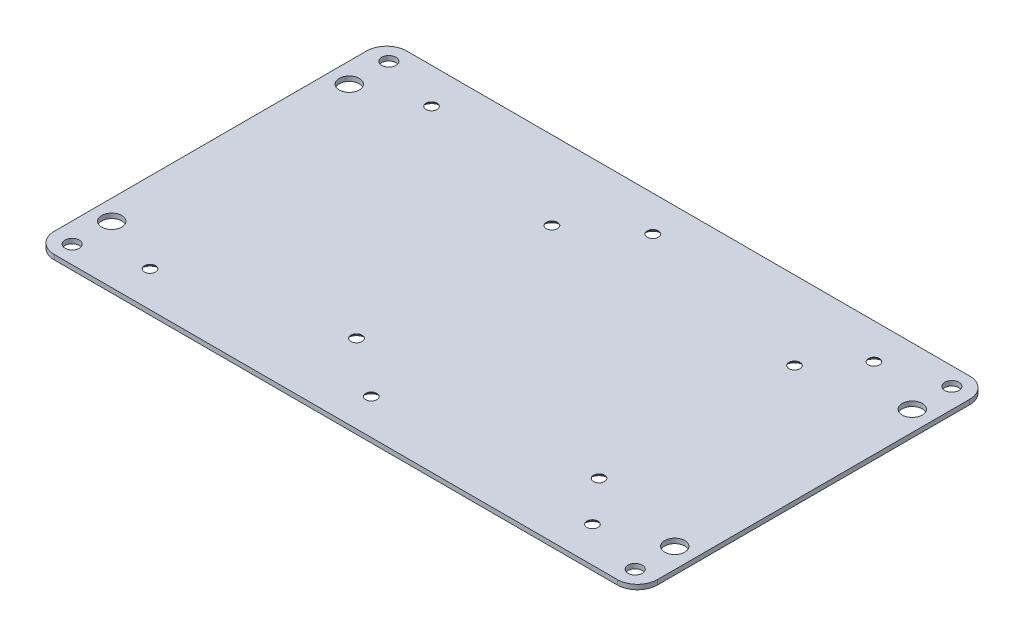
ISO-10303-21;
HEADER;
FILE_DESCRIPTION(('STEP AP214'),'2;1');
FILE_NAME('part.step','',(''),(''),'','','');
FILE_SCHEMA(('AUTOMOTIVE_DESIGN { 1 0 10303 214 1 1 1 1 }'));
ENDSEC;
DATA;
#1=APPLICATION_CONTEXT('core data for automotive mechanical design processes');
#2=APPLICATION_PROTOCOL_DEFINITION('international standard','automotive_design',2000,#1);
#3=PRODUCT_CONTEXT('',#1,'mechanical');
#4=PRODUCT('Part','Part','',(#3));
#5=PRODUCT_RELATED_PRODUCT_CATEGORY('part','',(#4));
#6=PRODUCT_DEFINITION_FORMATION('','',#4);
#7=PRODUCT_DEFINITION_CONTEXT('part definition',#1,'design');
#8=PRODUCT_DEFINITION('design','',#6,#7);
#9=PRODUCT_DEFINITION_SHAPE('','',#8);
#10=(LENGTH_UNIT() NAMED_UNIT(*) SI_UNIT(.MILLI.,.METRE.));
#11=(NAMED_UNIT(*) PLANE_ANGLE_UNIT() SI_UNIT($,.RADIAN.));
#12=(NAMED_UNIT(*) SI_UNIT($,.STERADIAN.) SOLID_ANGLE_UNIT());
#13=UNCERTAINTY_MEASURE_WITH_UNIT(LENGTH_MEASURE(1.E-05),#10,'distance_accuracy_value','');
#14=(GEOMETRIC_REPRESENTATION_CONTEXT(3) GLOBAL_UNCERTAINTY_ASSIGNED_CONTEXT((#13)) GLOBAL_UNIT_ASSIGNED_CONTEXT((#10,
#11,#12)) REPRESENTATION_CONTEXT('',''));
#15=CARTESIAN_POINT('',(0.,0.,0.));
#16=DIRECTION('',(0.,0.,1.));
#17=DIRECTION('',(1.,0.,0.));
#18=AXIS2_PLACEMENT_3D('',#15,#16,#17);
#19=CARTESIAN_POINT('',(0.,-1.5,0.));
#20=DIRECTION('',(0.,1.,0.));
#21=DIRECTION('',(0.,0.,1.));
#22=AXIS2_PLACEMENT_3D('',#19,#20,#21);
#23=PLANE('',#22);
#24=CARTESIAN_POINT('',(-88.9,-1.5,-105.65));
#25=DIRECTION('',(0.,1.,0.));
#26=DIRECTION('',(0.,0.,1.));
#27=AXIS2_PLACEMENT_3D('',#24,#25,#26);
#28=CIRCLE('',#27,2.25);
#29=CARTESIAN_POINT('',(-88.9,-1.5,-103.4));
#30=VERTEX_POINT('',#29);
#31=EDGE_CURVE('E435',#30,#30,#28,.T.);
#32=ORIENTED_EDGE('',*,*,#31,.T.);
#33=EDGE_LOOP('',(#32));
#34=FACE_BOUND('',#33,.T.);
#35=CARTESIAN_POINT('',(-88.9,-1.5,-5.65));
#36=DIRECTION('',(0.,1.,0.));
#37=DIRECTION('',(0.,0.,1.));
#38=AXIS2_PLACEMENT_3D('',#35,#36,#37);
#39=CIRCLE('',#38,2.25);
#40=CARTESIAN_POINT('',(-88.9,-1.5,-3.4));
#41=VERTEX_POINT('',#40);
#42=EDGE_CURVE('E373',#41,#41,#39,.T.);
#43=ORIENTED_EDGE('',*,*,#42,.T.);
#44=EDGE_LOOP('',(#43));
#45=FACE_BOUND('',#44,.T.);
#46=CARTESIAN_POINT('',(88.9,-1.5,-5.65));
#47=DIRECTION('',(0.,1.,0.));
#48=DIRECTION('',(0.,0.,1.));
#49=AXIS2_PLACEMENT_3D('',#46,#47,#48);
#50=CIRCLE('',#49,2.25);
#51=CARTESIAN_POINT('',(88.9,-1.5,-3.4));
#52=VERTEX_POINT('',#51);
#53=EDGE_CURVE('E372',#52,#52,#50,.T.);
#54=ORIENTED_EDGE('',*,*,#53,.T.);
#55=EDGE_LOOP('',(#54));
#56=FACE_BOUND('',#55,.T.);
#57=CARTESIAN_POINT('',(88.9,-1.5,-105.65));
#58=DIRECTION('',(0.,1.,0.));
#59=DIRECTION('',(0.,0.,1.));
#60=AXIS2_PLACEMENT_3D('',#57,#58,#59);
#61=CIRCLE('',#60,2.25);
#62=CARTESIAN_POINT('',(88.9,-1.5,-103.4));
#63=VERTEX_POINT('',#62);
#64=EDGE_CURVE('E205',#63,#63,#61,.T.);
#65=ORIENTED_EDGE('',*,*,#64,.T.);
#66=EDGE_LOOP('',(#65));
#67=FACE_BOUND('',#66,.T.);
#68=CARTESIAN_POINT('',(-88.9,-1.5,-93.15));
#69=DIRECTION('',(0.,1.,0.));
#70=DIRECTION('',(0.,0.,1.));
#71=AXIS2_PLACEMENT_3D('',#68,#69,#70);
#72=CIRCLE('',#71,3.175);
#73=CARTESIAN_POINT('',(-88.9,-1.5,-89.975));
#74=VERTEX_POINT('',#73);
#75=EDGE_CURVE('E312',#74,#74,#72,.T.);
#76=ORIENTED_EDGE('',*,*,#75,.T.);
#77=EDGE_LOOP('',(#76));
#78=FACE_BOUND('',#77,.T.);
#79=CARTESIAN_POINT('',(-88.9,-1.5,-18.15));
#80=DIRECTION('',(0.,1.,0.));
#81=DIRECTION('',(0.,0.,1.));
#82=AXIS2_PLACEMENT_3D('',#79,#80,#81);
#83=CIRCLE('',#82,3.175);
#84=CARTESIAN_POINT('',(-88.9,-1.5,-14.975));
#85=VERTEX_POINT('',#84);
#86=EDGE_CURVE('E347',#85,#85,#83,.T.);
#87=ORIENTED_EDGE('',*,*,#86,.T.);
#88=EDGE_LOOP('',(#87));
#89=FACE_BOUND('',#88,.T.);
#90=CARTESIAN_POINT('',(88.9,-1.5,-93.15));
#91=DIRECTION('',(0.,1.,0.));
#92=DIRECTION('',(0.,0.,1.));
#93=AXIS2_PLACEMENT_3D('',#90,#91,#92);
#94=CIRCLE('',#93,3.175);
#95=CARTESIAN_POINT('',(88.9,-1.5,-89.975));
#96=VERTEX_POINT('',#95);
#97=EDGE_CURVE('E220',#96,#96,#94,.T.);
#98=ORIENTED_EDGE('',*,*,#97,.T.);
#99=EDGE_LOOP('',(#98));
#100=FACE_BOUND('',#99,.T.);
#101=CARTESIAN_POINT('',(88.9,-1.5,-18.15));
#102=DIRECTION('',(0.,1.,0.));
#103=DIRECTION('',(0.,0.,1.));
#104=AXIS2_PLACEMENT_3D('',#101,#102,#103);
#105=CIRCLE('',#104,3.175);
#106=CARTESIAN_POINT('',(88.9,-1.5,-14.975));
#107=VERTEX_POINT('',#106);
#108=EDGE_CURVE('E219',#107,#107,#105,.T.);
#109=ORIENTED_EDGE('',*,*,#108,.T.);
#110=EDGE_LOOP('',(#109));
#111=FACE_BOUND('',#110,.T.);
#112=CARTESIAN_POINT('',(-69.85,-1.5,-11.2));
#113=DIRECTION('',(0.,-1.,0.));
#114=DIRECTION('',(0.,0.,-1.));
#115=AXIS2_PLACEMENT_3D('',#112,#113,#114);
#116=CIRCLE('',#115,3.15);
#117=CARTESIAN_POINT('',(-69.85,-1.5,-14.35));
#118=VERTEX_POINT('',#117);
#119=EDGE_CURVE('E253',#118,#118,#116,.T.);
#120=ORIENTED_EDGE('',*,*,#119,.F.);
#121=EDGE_LOOP('',(#120));
#122=FACE_BOUND('',#121,.T.);
#123=DIRECTION('',(1.,0.,0.));
#124=VECTOR('',#123,1.);
#125=CARTESIAN_POINT('',(-95.25,-1.5,0.));
#126=LINE('',#125,#124);
#127=CARTESIAN_POINT('',(-88.9,-1.5,0.));
#128=VERTEX_POINT('',#127);
#129=CARTESIAN_POINT('',(88.9,-1.5,0.));
#130=VERTEX_POINT('',#129);
#131=EDGE_CURVE('E200',#128,#130,#126,.T.);
#132=ORIENTED_EDGE('',*,*,#131,.F.);
#133=CARTESIAN_POINT('',(-88.9,-1.5,-6.34999999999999));
#134=DIRECTION('',(0.,1.,0.));
#135=DIRECTION('',(0.,0.,1.));
#136=AXIS2_PLACEMENT_3D('',#133,#134,#135);
#137=CIRCLE('',#136,6.35);
#138=CARTESIAN_POINT('',(-95.25,-1.5,-6.34999999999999));
#139=VERTEX_POINT('',#138);
#140=EDGE_CURVE('E183',#128,#139,#137,.F.);
#141=ORIENTED_EDGE('',*,*,#140,.T.);
#142=DIRECTION('',(0.,0.,1.));
#143=VECTOR('',#142,1.);
#144=CARTESIAN_POINT('',(-95.25,-1.5,-111.3));
#145=LINE('',#144,#143);
#146=CARTESIAN_POINT('',(-95.25,-1.5,-104.95));
#147=VERTEX_POINT('',#146);
#148=EDGE_CURVE('E318',#147,#139,#145,.T.);
#149=ORIENTED_EDGE('',*,*,#148,.F.);
#150=CARTESIAN_POINT('',(-88.9,-1.5,-104.95));
#151=DIRECTION('',(0.,1.,0.));
#152=DIRECTION('',(0.,0.,1.));
#153=AXIS2_PLACEMENT_3D('',#150,#151,#152);
#154=CIRCLE('',#153,6.35);
#155=CARTESIAN_POINT('',(-88.9,-1.5,-111.3));
#156=VERTEX_POINT('',#155);
#157=EDGE_CURVE('E146',#147,#156,#154,.F.);
#158=ORIENTED_EDGE('',*,*,#157,.T.);
#159=DIRECTION('',(-1.,0.,0.));
#160=VECTOR('',#159,1.);
#161=CARTESIAN_POINT('',(-95.25,-1.5,-111.3));
#162=LINE('',#161,#160);
#163=CARTESIAN_POINT('',(88.9,-1.5,-111.3));
#164=VERTEX_POINT('',#163);
#165=EDGE_CURVE('E148',#164,#156,#162,.T.);
#166=ORIENTED_EDGE('',*,*,#165,.F.);
#167=CARTESIAN_POINT('',(88.9,-1.5,-104.95));
#168=DIRECTION('',(0.,1.,0.));
#169=DIRECTION('',(0.,0.,1.));
#170=AXIS2_PLACEMENT_3D('',#167,#168,#169);
#171=CIRCLE('',#170,6.35);
#172=CARTESIAN_POINT('',(95.25,-1.5,-104.95));
#173=VERTEX_POINT('',#172);
#174=EDGE_CURVE('E67',#164,#173,#171,.F.);
#175=ORIENTED_EDGE('',*,*,#174,.T.);
#176=DIRECTION('',(0.,0.,-1.));
#177=VECTOR('',#176,1.);
#178=CARTESIAN_POINT('',(95.25,-1.5,-111.3));
#179=LINE('',#178,#177);
#180=CARTESIAN_POINT('',(95.25,-1.5,-6.34999999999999));
#181=VERTEX_POINT('',#180);
#182=EDGE_CURVE('E158',#181,#173,#179,.T.);
#183=ORIENTED_EDGE('',*,*,#182,.F.);
#184=CARTESIAN_POINT('',(88.9,-1.5,-6.35));
#185=DIRECTION('',(0.,1.,0.));
#186=DIRECTION('',(0.,0.,1.));
#187=AXIS2_PLACEMENT_3D('',#184,#185,#186);
#188=CIRCLE('',#187,6.35);
#189=EDGE_CURVE('E176',#181,#130,#188,.F.);
#190=ORIENTED_EDGE('',*,*,#189,.T.);
#191=EDGE_LOOP('',(#132,#141,#149,#158,#166,#175,#183,#190));
#192=FACE_BOUND('',#191,.T.);
#193=CARTESIAN_POINT('',(0.,-1.5,-100.1));
#194=DIRECTION('',(0.,-1.,0.));
#195=DIRECTION('',(0.,0.,-1.));
#196=AXIS2_PLACEMENT_3D('',#193,#194,#195);
#197=CIRCLE('',#196,3.15);
#198=CARTESIAN_POINT('',(0.,-1.5,-103.25));
#199=VERTEX_POINT('',#198);
#200=EDGE_CURVE('E298',#199,#199,#197,.T.);
#201=ORIENTED_EDGE('',*,*,#200,.F.);
#202=EDGE_LOOP('',(#201));
#203=FACE_BOUND('',#202,.T.);
#204=CARTESIAN_POINT('',(0.,-1.5,-11.2));
#205=DIRECTION('',(0.,-1.,0.));
#206=DIRECTION('',(0.,0.,-1.));
#207=AXIS2_PLACEMENT_3D('',#204,#205,#206);
#208=CIRCLE('',#207,3.15);
#209=CARTESIAN_POINT('',(0.,-1.5,-14.35));
#210=VERTEX_POINT('',#209);
#211=EDGE_CURVE('E243',#210,#210,#208,.T.);
#212=ORIENTED_EDGE('',*,*,#211,.F.);
#213=EDGE_LOOP('',(#212));
#214=FACE_BOUND('',#213,.T.);
#215=CARTESIAN_POINT('',(-69.85,-1.5,-100.1));
#216=DIRECTION('',(0.,-1.,0.));
#217=DIRECTION('',(0.,0.,-1.));
#218=AXIS2_PLACEMENT_3D('',#215,#216,#217);
#219=CIRCLE('',#218,3.15);
#220=CARTESIAN_POINT('',(-69.85,-1.5,-103.25));
#221=VERTEX_POINT('',#220);
#222=EDGE_CURVE('E267',#221,#221,#219,.T.);
#223=ORIENTED_EDGE('',*,*,#222,.F.);
#224=EDGE_LOOP('',(#223));
#225=FACE_BOUND('',#224,.T.);
#226=CARTESIAN_POINT('',(69.85,-1.5,-11.2));
#227=DIRECTION('',(0.,-1.,0.));
#228=DIRECTION('',(0.,0.,-1.));
#229=AXIS2_PLACEMENT_3D('',#226,#227,#228);
#230=CIRCLE('',#229,3.15);
#231=CARTESIAN_POINT('',(69.85,-1.5,-14.35));
#232=VERTEX_POINT('',#231);
#233=EDGE_CURVE('E275',#232,#232,#230,.T.);
#234=ORIENTED_EDGE('',*,*,#233,.F.);
#235=EDGE_LOOP('',(#234));
#236=FACE_BOUND('',#235,.T.);
#237=CARTESIAN_POINT('',(69.85,-1.5,-100.1));
#238=DIRECTION('',(0.,-1.,0.));
#239=DIRECTION('',(0.,0.,-1.));
#240=AXIS2_PLACEMENT_3D('',#237,#238,#239);
#241=CIRCLE('',#240,3.15);
#242=CARTESIAN_POINT('',(69.85,-1.5,-103.25));
#243=VERTEX_POINT('',#242);
#244=EDGE_CURVE('E323',#243,#243,#241,.T.);
#245=ORIENTED_EDGE('',*,*,#244,.F.);
#246=EDGE_LOOP('',(#245));
#247=FACE_BOUND('',#246,.T.);
#248=CARTESIAN_POINT('',(58.35,-1.5,-24.79));
#249=DIRECTION('',(0.,-1.,0.));
#250=DIRECTION('',(0.,0.,-1.));
#251=AXIS2_PLACEMENT_3D('',#248,#249,#250);
#252=CIRCLE('',#251,3.15);
#253=CARTESIAN_POINT('',(58.35,-1.5,-27.94));
#254=VERTEX_POINT('',#253);
#255=EDGE_CURVE('E284',#254,#254,#252,.T.);
#256=ORIENTED_EDGE('',*,*,#255,.F.);
#257=EDGE_LOOP('',(#256));
#258=FACE_BOUND('',#257,.T.);
#259=CARTESIAN_POINT('',(58.35,-1.5,-86.51));
#260=DIRECTION('',(0.,-1.,0.));
#261=DIRECTION('',(0.,0.,-1.));
#262=AXIS2_PLACEMENT_3D('',#259,#260,#261);
#263=CIRCLE('',#262,3.15);
#264=CARTESIAN_POINT('',(58.35,-1.5,-89.66));
#265=VERTEX_POINT('',#264);
#266=EDGE_CURVE('E353',#265,#265,#263,.T.);
#267=ORIENTED_EDGE('',*,*,#266,.F.);
#268=EDGE_LOOP('',(#267));
#269=FACE_BOUND('',#268,.T.);
#270=CARTESIAN_POINT('',(-18.25,-1.5,-86.51));
#271=DIRECTION('',(0.,-1.,0.));
#272=DIRECTION('',(0.,0.,-1.));
#273=AXIS2_PLACEMENT_3D('',#270,#271,#272);
#274=CIRCLE('',#273,3.15);
#275=CARTESIAN_POINT('',(-18.25,-1.5,-89.66));
#276=VERTEX_POINT('',#275);
#277=EDGE_CURVE('E338',#276,#276,#274,.T.);
#278=ORIENTED_EDGE('',*,*,#277,.F.);
#279=EDGE_LOOP('',(#278));
#280=FACE_BOUND('',#279,.T.);
#281=CARTESIAN_POINT('',(-18.25,-1.5,-24.79));
#282=DIRECTION('',(0.,-1.,0.));
#283=DIRECTION('',(0.,0.,-1.));
#284=AXIS2_PLACEMENT_3D('',#281,#282,#283);
#285=CIRCLE('',#284,3.15);
#286=CARTESIAN_POINT('',(-18.25,-1.5,-27.94));
#287=VERTEX_POINT('',#286);
#288=EDGE_CURVE('E235',#287,#287,#285,.T.);
#289=ORIENTED_EDGE('',*,*,#288,.F.);
#290=EDGE_LOOP('',(#289));
#291=FACE_BOUND('',#290,.T.);
#292=ADVANCED_FACE('F51',(#34,#45,#56,#67,#78,#89,#100,#111,#122,#192,#203,#214,#225,#236,#247,
#258,#269,#280,#291),#23,.F.);
#293=CARTESIAN_POINT('',(-95.25,-1.5,-111.3));
#294=DIRECTION('',(-1.,0.,0.));
#295=DIRECTION('',(0.,0.,1.));
#296=AXIS2_PLACEMENT_3D('',#293,#294,#295);
#297=PLANE('',#296);
#298=ORIENTED_EDGE('',*,*,#148,.T.);
#299=DIRECTION('',(0.,1.,0.));
#300=VECTOR('',#299,1.);
#301=CARTESIAN_POINT('',(-95.25,-1.5,-6.34999999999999));
#302=LINE('',#301,#300);
#303=CARTESIAN_POINT('',(-95.25,0.,-6.34999999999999));
#304=VERTEX_POINT('',#303);
#305=EDGE_CURVE('E139',#139,#304,#302,.T.);
#306=ORIENTED_EDGE('',*,*,#305,.T.);
#307=DIRECTION('',(0.,0.,1.));
#308=VECTOR('',#307,1.);
#309=CARTESIAN_POINT('',(-95.25,0.,-111.3));
#310=LINE('',#309,#308);
#311=CARTESIAN_POINT('',(-95.25,0.,-104.95));
#312=VERTEX_POINT('',#311);
#313=EDGE_CURVE('E121',#312,#304,#310,.T.);
#314=ORIENTED_EDGE('',*,*,#313,.F.);
#315=DIRECTION('',(0.,1.,0.));
#316=VECTOR('',#315,1.);
#317=CARTESIAN_POINT('',(-95.25,-1.5,-104.95));
#318=LINE('',#317,#316);
#319=EDGE_CURVE('E136',#312,#147,#318,.F.);
#320=ORIENTED_EDGE('',*,*,#319,.T.);
#321=EDGE_LOOP('',(#298,#306,#314,#320));
#322=FACE_BOUND('',#321,.T.);
#323=ADVANCED_FACE('F135',(#322),#297,.T.);
#324=CARTESIAN_POINT('',(-95.25,-1.5,-111.3));
#325=DIRECTION('',(0.,0.,-1.));
#326=DIRECTION('',(-1.,0.,0.));
#327=AXIS2_PLACEMENT_3D('',#324,#325,#326);
#328=PLANE('',#327);
#329=ORIENTED_EDGE('',*,*,#165,.T.);
#330=DIRECTION('',(0.,1.,0.));
#331=VECTOR('',#330,1.);
#332=CARTESIAN_POINT('',(-88.9,-1.5,-111.3));
#333=LINE('',#332,#331);
#334=CARTESIAN_POINT('',(-88.9,0.,-111.3));
#335=VERTEX_POINT('',#334);
#336=EDGE_CURVE('E189',#156,#335,#333,.T.);
#337=ORIENTED_EDGE('',*,*,#336,.T.);
#338=DIRECTION('',(-1.,0.,0.));
#339=VECTOR('',#338,1.);
#340=CARTESIAN_POINT('',(-95.25,0.,-111.3));
#341=LINE('',#340,#339);
#342=CARTESIAN_POINT('',(88.9,0.,-111.3));
#343=VERTEX_POINT('',#342);
#344=EDGE_CURVE('E123',#343,#335,#341,.T.);
#345=ORIENTED_EDGE('',*,*,#344,.F.);
#346=DIRECTION('',(0.,1.,0.));
#347=VECTOR('',#346,1.);
#348=CARTESIAN_POINT('',(88.9,-1.5,-111.3));
#349=LINE('',#348,#347);
#350=EDGE_CURVE('E186',#343,#164,#349,.F.);
#351=ORIENTED_EDGE('',*,*,#350,.T.);
#352=EDGE_LOOP('',(#329,#337,#345,#351));
#353=FACE_BOUND('',#352,.T.);
#354=ADVANCED_FACE('F541',(#353),#328,.T.);
#355=CARTESIAN_POINT('',(95.25,-1.5,-111.3));
#356=DIRECTION('',(1.,0.,0.));
#357=DIRECTION('',(0.,0.,-1.));
#358=AXIS2_PLACEMENT_3D('',#355,#356,#357);
#359=PLANE('',#358);
#360=ORIENTED_EDGE('',*,*,#182,.T.);
#361=DIRECTION('',(0.,1.,0.));
#362=VECTOR('',#361,1.);
#363=CARTESIAN_POINT('',(95.25,-1.5,-104.95));
#364=LINE('',#363,#362);
#365=CARTESIAN_POINT('',(95.25,0.,-104.95));
#366=VERTEX_POINT('',#365);
#367=EDGE_CURVE('E11',#173,#366,#364,.T.);
#368=ORIENTED_EDGE('',*,*,#367,.T.);
#369=DIRECTION('',(0.,0.,-1.));
#370=VECTOR('',#369,1.);
#371=CARTESIAN_POINT('',(95.25,0.,-111.3));
#372=LINE('',#371,#370);
#373=CARTESIAN_POINT('',(95.25,0.,-6.34999999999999));
#374=VERTEX_POINT('',#373);
#375=EDGE_CURVE('E319',#374,#366,#372,.T.);
#376=ORIENTED_EDGE('',*,*,#375,.F.);
#377=DIRECTION('',(0.,1.,0.));
#378=VECTOR('',#377,1.);
#379=CARTESIAN_POINT('',(95.25,-1.5,-6.34999999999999));
#380=LINE('',#379,#378);
#381=EDGE_CURVE('E60',#374,#181,#380,.F.);
#382=ORIENTED_EDGE('',*,*,#381,.T.);
#383=EDGE_LOOP('',(#360,#368,#376,#382));
#384=FACE_BOUND('',#383,.T.);
#385=ADVANCED_FACE('F535',(#384),#359,.T.);
#386=CARTESIAN_POINT('',(-95.25,-1.5,0.));
#387=DIRECTION('',(0.,0.,1.));
#388=DIRECTION('',(1.,0.,0.));
#389=AXIS2_PLACEMENT_3D('',#386,#387,#388);
#390=PLANE('',#389);
#391=DIRECTION('',(1.,0.,0.));
#392=VECTOR('',#391,1.);
#393=CARTESIAN_POINT('',(-95.25,0.,0.));
#394=LINE('',#393,#392);
#395=CARTESIAN_POINT('',(-88.9,0.,0.));
#396=VERTEX_POINT('',#395);
#397=CARTESIAN_POINT('',(88.9,0.,0.));
#398=VERTEX_POINT('',#397);
#399=EDGE_CURVE('E141',#396,#398,#394,.T.);
#400=ORIENTED_EDGE('',*,*,#399,.F.);
#401=DIRECTION('',(0.,1.,0.));
#402=VECTOR('',#401,1.);
#403=CARTESIAN_POINT('',(-88.9,-1.5,0.));
#404=LINE('',#403,#402);
#405=EDGE_CURVE('E173',#396,#128,#404,.F.);
#406=ORIENTED_EDGE('',*,*,#405,.T.);
#407=ORIENTED_EDGE('',*,*,#131,.T.);
#408=DIRECTION('',(0.,1.,0.));
#409=VECTOR('',#408,1.);
#410=CARTESIAN_POINT('',(88.9,-1.5,0.));
#411=LINE('',#410,#409);
#412=EDGE_CURVE('E169',#130,#398,#411,.T.);
#413=ORIENTED_EDGE('',*,*,#412,.T.);
#414=EDGE_LOOP('',(#400,#406,#407,#413));
#415=FACE_BOUND('',#414,.T.);
#416=ADVANCED_FACE('F530',(#415),#390,.T.);
#417=CARTESIAN_POINT('',(0.,0.,0.));
#418=DIRECTION('',(0.,1.,0.));
#419=DIRECTION('',(0.,0.,1.));
#420=AXIS2_PLACEMENT_3D('',#417,#418,#419);
#421=PLANE('',#420);
#422=CARTESIAN_POINT('',(-18.25,0.,-24.79));
#423=DIRECTION('',(0.,1.,0.));
#424=DIRECTION('',(0.,0.,1.));
#425=AXIS2_PLACEMENT_3D('',#422,#423,#424);
#426=CIRCLE('',#425,1.75);
#427=CARTESIAN_POINT('',(-18.25,0.,-23.04));
#428=VERTEX_POINT('',#427);
#429=EDGE_CURVE('E301',#428,#428,#426,.T.);
#430=ORIENTED_EDGE('',*,*,#429,.F.);
#431=EDGE_LOOP('',(#430));
#432=FACE_BOUND('',#431,.T.);
#433=CARTESIAN_POINT('',(-18.25,0.,-86.51));
#434=DIRECTION('',(0.,1.,0.));
#435=DIRECTION('',(0.,0.,1.));
#436=AXIS2_PLACEMENT_3D('',#433,#434,#435);
#437=CIRCLE('',#436,1.75);
#438=CARTESIAN_POINT('',(-18.25,0.,-84.76));
#439=VERTEX_POINT('',#438);
#440=EDGE_CURVE('E337',#439,#439,#437,.T.);
#441=ORIENTED_EDGE('',*,*,#440,.F.);
#442=EDGE_LOOP('',(#441));
#443=FACE_BOUND('',#442,.T.);
#444=CARTESIAN_POINT('',(58.35,0.,-86.51));
#445=DIRECTION('',(0.,1.,0.));
#446=DIRECTION('',(0.,0.,1.));
#447=AXIS2_PLACEMENT_3D('',#444,#445,#446);
#448=CIRCLE('',#447,1.75);
#449=CARTESIAN_POINT('',(58.35,0.,-84.76));
#450=VERTEX_POINT('',#449);
#451=EDGE_CURVE('E281',#450,#450,#448,.T.);
#452=ORIENTED_EDGE('',*,*,#451,.F.);
#453=EDGE_LOOP('',(#452));
#454=FACE_BOUND('',#453,.T.);
#455=CARTESIAN_POINT('',(58.35,0.,-24.79));
#456=DIRECTION('',(0.,1.,0.));
#457=DIRECTION('',(0.,0.,1.));
#458=AXIS2_PLACEMENT_3D('',#455,#456,#457);
#459=CIRCLE('',#458,1.75);
#460=CARTESIAN_POINT('',(58.35,0.,-23.04));
#461=VERTEX_POINT('',#460);
#462=EDGE_CURVE('E225',#461,#461,#459,.T.);
#463=ORIENTED_EDGE('',*,*,#462,.F.);
#464=EDGE_LOOP('',(#463));
#465=FACE_BOUND('',#464,.T.);
#466=CARTESIAN_POINT('',(-88.9,0.,-105.65));
#467=DIRECTION('',(0.,1.,0.));
#468=DIRECTION('',(0.,0.,1.));
#469=AXIS2_PLACEMENT_3D('',#466,#467,#468);
#470=CIRCLE('',#469,2.25);
#471=CARTESIAN_POINT('',(-88.9,0.,-103.4));
#472=VERTEX_POINT('',#471);
#473=EDGE_CURVE('E229',#472,#472,#470,.T.);
#474=ORIENTED_EDGE('',*,*,#473,.F.);
#475=EDGE_LOOP('',(#474));
#476=FACE_BOUND('',#475,.T.);
#477=CARTESIAN_POINT('',(-88.9,0.,-5.65));
#478=DIRECTION('',(0.,1.,0.));
#479=DIRECTION('',(0.,0.,1.));
#480=AXIS2_PLACEMENT_3D('',#477,#478,#479);
#481=CIRCLE('',#480,2.25);
#482=CARTESIAN_POINT('',(-88.9,0.,-3.4));
#483=VERTEX_POINT('',#482);
#484=EDGE_CURVE('E438',#483,#483,#481,.T.);
#485=ORIENTED_EDGE('',*,*,#484,.F.);
#486=EDGE_LOOP('',(#485));
#487=FACE_BOUND('',#486,.T.);
#488=CARTESIAN_POINT('',(88.9,0.,-5.65));
#489=DIRECTION('',(0.,1.,0.));
#490=DIRECTION('',(0.,0.,1.));
#491=AXIS2_PLACEMENT_3D('',#488,#489,#490);
#492=CIRCLE('',#491,2.25);
#493=CARTESIAN_POINT('',(88.9,0.,-3.4));
#494=VERTEX_POINT('',#493);
#495=EDGE_CURVE('E368',#494,#494,#492,.T.);
#496=ORIENTED_EDGE('',*,*,#495,.F.);
#497=EDGE_LOOP('',(#496));
#498=FACE_BOUND('',#497,.T.);
#499=CARTESIAN_POINT('',(88.9,0.,-105.65));
#500=DIRECTION('',(0.,1.,0.));
#501=DIRECTION('',(0.,0.,1.));
#502=AXIS2_PLACEMENT_3D('',#499,#500,#501);
#503=CIRCLE('',#502,2.25);
#504=CARTESIAN_POINT('',(88.9,0.,-103.4));
#505=VERTEX_POINT('',#504);
#506=EDGE_CURVE('E210',#505,#505,#503,.T.);
#507=ORIENTED_EDGE('',*,*,#506,.F.);
#508=EDGE_LOOP('',(#507));
#509=FACE_BOUND('',#508,.T.);
#510=CARTESIAN_POINT('',(-88.9,0.,-93.15));
#511=DIRECTION('',(0.,1.,0.));
#512=DIRECTION('',(0.,0.,1.));
#513=AXIS2_PLACEMENT_3D('',#510,#511,#512);
#514=CIRCLE('',#513,3.175);
#515=CARTESIAN_POINT('',(-88.9,0.,-89.975));
#516=VERTEX_POINT('',#515);
#517=EDGE_CURVE('E209',#516,#516,#514,.T.);
#518=ORIENTED_EDGE('',*,*,#517,.F.);
#519=EDGE_LOOP('',(#518));
#520=FACE_BOUND('',#519,.T.);
#521=CARTESIAN_POINT('',(-88.9,0.,-18.15));
#522=DIRECTION('',(0.,1.,0.));
#523=DIRECTION('',(0.,0.,1.));
#524=AXIS2_PLACEMENT_3D('',#521,#522,#523);
#525=CIRCLE('',#524,3.175);
#526=CARTESIAN_POINT('',(-88.9,0.,-14.975));
#527=VERTEX_POINT('',#526);
#528=EDGE_CURVE('E343',#527,#527,#525,.T.);
#529=ORIENTED_EDGE('',*,*,#528,.F.);
#530=EDGE_LOOP('',(#529));
#531=FACE_BOUND('',#530,.T.);
#532=CARTESIAN_POINT('',(88.9,0.,-93.15));
#533=DIRECTION('',(0.,1.,0.));
#534=DIRECTION('',(0.,0.,1.));
#535=AXIS2_PLACEMENT_3D('',#532,#533,#534);
#536=CIRCLE('',#535,3.175);
#537=CARTESIAN_POINT('',(88.9,0.,-89.975));
#538=VERTEX_POINT('',#537);
#539=EDGE_CURVE('E394',#538,#538,#536,.T.);
#540=ORIENTED_EDGE('',*,*,#539,.F.);
#541=EDGE_LOOP('',(#540));
#542=FACE_BOUND('',#541,.T.);
#543=CARTESIAN_POINT('',(88.9,0.,-18.15));
#544=DIRECTION('',(0.,1.,0.));
#545=DIRECTION('',(0.,0.,1.));
#546=AXIS2_PLACEMENT_3D('',#543,#544,#545);
#547=CIRCLE('',#546,3.175);
#548=CARTESIAN_POINT('',(88.9,0.,-14.975));
#549=VERTEX_POINT('',#548);
#550=EDGE_CURVE('E215',#549,#549,#547,.T.);
#551=ORIENTED_EDGE('',*,*,#550,.F.);
#552=EDGE_LOOP('',(#551));
#553=FACE_BOUND('',#552,.T.);
#554=CARTESIAN_POINT('',(69.85,0.,-100.1));
#555=DIRECTION('',(0.,1.,0.));
#556=DIRECTION('',(0.,0.,1.));
#557=AXIS2_PLACEMENT_3D('',#554,#555,#556);
#558=CIRCLE('',#557,1.75);
#559=CARTESIAN_POINT('',(69.85,0.,-98.35));
#560=VERTEX_POINT('',#559);
#561=EDGE_CURVE('E271',#560,#560,#558,.T.);
#562=ORIENTED_EDGE('',*,*,#561,.F.);
#563=EDGE_LOOP('',(#562));
#564=FACE_BOUND('',#563,.T.);
#565=CARTESIAN_POINT('',(69.85,0.,-11.2));
#566=DIRECTION('',(0.,1.,0.));
#567=DIRECTION('',(0.,0.,1.));
#568=AXIS2_PLACEMENT_3D('',#565,#566,#567);
#569=CIRCLE('',#568,1.75);
#570=CARTESIAN_POINT('',(69.85,0.,-9.45000000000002));
#571=VERTEX_POINT('',#570);
#572=EDGE_CURVE('E258',#571,#571,#569,.T.);
#573=ORIENTED_EDGE('',*,*,#572,.F.);
#574=EDGE_LOOP('',(#573));
#575=FACE_BOUND('',#574,.T.);
#576=CARTESIAN_POINT('',(-69.85,0.,-11.2));
#577=DIRECTION('',(0.,1.,0.));
#578=DIRECTION('',(0.,0.,1.));
#579=AXIS2_PLACEMENT_3D('',#576,#577,#578);
#580=CIRCLE('',#579,1.75);
#581=CARTESIAN_POINT('',(-69.85,0.,-9.45));
#582=VERTEX_POINT('',#581);
#583=EDGE_CURVE('E383',#582,#582,#580,.T.);
#584=ORIENTED_EDGE('',*,*,#583,.F.);
#585=EDGE_LOOP('',(#584));
#586=FACE_BOUND('',#585,.T.);
#587=CARTESIAN_POINT('',(-69.85,0.,-100.1));
#588=DIRECTION('',(0.,1.,0.));
#589=DIRECTION('',(0.,0.,1.));
#590=AXIS2_PLACEMENT_3D('',#587,#588,#589);
#591=CIRCLE('',#590,1.75);
#592=CARTESIAN_POINT('',(-69.85,0.,-98.35));
#593=VERTEX_POINT('',#592);
#594=EDGE_CURVE('E248',#593,#593,#591,.T.);
#595=ORIENTED_EDGE('',*,*,#594,.F.);
#596=EDGE_LOOP('',(#595));
#597=FACE_BOUND('',#596,.T.);
#598=CARTESIAN_POINT('',(0.,0.,-11.2));
#599=DIRECTION('',(0.,1.,0.));
#600=DIRECTION('',(0.,0.,1.));
#601=AXIS2_PLACEMENT_3D('',#598,#599,#600);
#602=CIRCLE('',#601,1.75);
#603=CARTESIAN_POINT('',(0.,0.,-9.45000000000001));
#604=VERTEX_POINT('',#603);
#605=EDGE_CURVE('E444',#604,#604,#602,.T.);
#606=ORIENTED_EDGE('',*,*,#605,.F.);
#607=EDGE_LOOP('',(#606));
#608=FACE_BOUND('',#607,.T.);
#609=CARTESIAN_POINT('',(0.,0.,-100.1));
#610=DIRECTION('',(0.,1.,0.));
#611=DIRECTION('',(0.,0.,1.));
#612=AXIS2_PLACEMENT_3D('',#609,#610,#611);
#613=CIRCLE('',#612,1.75);
#614=CARTESIAN_POINT('',(0.,0.,-98.35));
#615=VERTEX_POINT('',#614);
#616=EDGE_CURVE('E142',#615,#615,#613,.T.);
#617=ORIENTED_EDGE('',*,*,#616,.F.);
#618=EDGE_LOOP('',(#617));
#619=FACE_BOUND('',#618,.T.);
#620=ORIENTED_EDGE('',*,*,#313,.T.);
#621=CARTESIAN_POINT('',(-88.9,0.,-6.34999999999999));
#622=DIRECTION('',(0.,1.,0.));
#623=DIRECTION('',(0.,0.,1.));
#624=AXIS2_PLACEMENT_3D('',#621,#622,#623);
#625=CIRCLE('',#624,6.35);
#626=EDGE_CURVE('E129',#304,#396,#625,.T.);
#627=ORIENTED_EDGE('',*,*,#626,.T.);
#628=ORIENTED_EDGE('',*,*,#399,.T.);
#629=CARTESIAN_POINT('',(88.9,0.,-6.35));
#630=DIRECTION('',(0.,1.,0.));
#631=DIRECTION('',(0.,0.,1.));
#632=AXIS2_PLACEMENT_3D('',#629,#630,#631);
#633=CIRCLE('',#632,6.35);
#634=EDGE_CURVE('E154',#398,#374,#633,.T.);
#635=ORIENTED_EDGE('',*,*,#634,.T.);
#636=ORIENTED_EDGE('',*,*,#375,.T.);
#637=CARTESIAN_POINT('',(88.9,0.,-104.95));
#638=DIRECTION('',(0.,1.,0.));
#639=DIRECTION('',(0.,0.,1.));
#640=AXIS2_PLACEMENT_3D('',#637,#638,#639);
#641=CIRCLE('',#640,6.35);
#642=EDGE_CURVE('E130',#366,#343,#641,.T.);
#643=ORIENTED_EDGE('',*,*,#642,.T.);
#644=ORIENTED_EDGE('',*,*,#344,.T.);
#645=CARTESIAN_POINT('',(-88.9,0.,-104.95));
#646=DIRECTION('',(0.,1.,0.));
#647=DIRECTION('',(0.,0.,1.));
#648=AXIS2_PLACEMENT_3D('',#645,#646,#647);
#649=CIRCLE('',#648,6.35);
#650=EDGE_CURVE('E118',#335,#312,#649,.T.);
#651=ORIENTED_EDGE('',*,*,#650,.T.);
#652=EDGE_LOOP('',(#620,#627,#628,#635,#636,#643,#644,#651));
#653=FACE_BOUND('',#652,.T.);
#654=ADVANCED_FACE('F120',(#432,#443,#454,#465,#476,#487,#498,#509,#520,#531,#542,#553,#564,
#575,#586,#597,#608,#619,#653),#421,.T.);
#655=CARTESIAN_POINT('',(0.,-1.5,-100.1));
#656=DIRECTION('',(0.,-1.,0.));
#657=DIRECTION('',(0.,0.,-1.));
#658=AXIS2_PLACEMENT_3D('',#655,#656,#657);
#659=CYLINDRICAL_SURFACE('',#658,1.75);
#660=CARTESIAN_POINT('',(0.,-0.100000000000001,-100.1));
#661=DIRECTION('',(0.,-1.,0.));
#662=DIRECTION('',(0.,0.,-1.));
#663=AXIS2_PLACEMENT_3D('',#660,#661,#662);
#664=CIRCLE('',#663,1.75);
#665=CARTESIAN_POINT('',(0.,-0.100000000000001,-101.85));
#666=VERTEX_POINT('',#665);
#667=EDGE_CURVE('E361',#666,#666,#664,.T.);
#668=ORIENTED_EDGE('',*,*,#667,.T.);
#669=EDGE_LOOP('',(#668));
#670=FACE_BOUND('',#669,.T.);
#671=ORIENTED_EDGE('',*,*,#616,.T.);
#672=EDGE_LOOP('',(#671));
#673=FACE_BOUND('',#672,.T.);
#674=ADVANCED_FACE('F673',(#670,#673),#659,.F.);
#675=CARTESIAN_POINT('',(0.,-1.5,-100.1));
#676=DIRECTION('',(0.,-1.,0.));
#677=DIRECTION('',(0.,0.,-1.));
#678=AXIS2_PLACEMENT_3D('',#675,#676,#677);
#679=CONICAL_SURFACE('',#678,3.15,0.785398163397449);
#680=ORIENTED_EDGE('',*,*,#667,.F.);
#681=EDGE_LOOP('',(#680));
#682=FACE_BOUND('',#681,.T.);
#683=ORIENTED_EDGE('',*,*,#200,.T.);
#684=EDGE_LOOP('',(#683));
#685=FACE_BOUND('',#684,.T.);
#686=ADVANCED_FACE('F669',(#682,#685),#679,.F.);
#687=CARTESIAN_POINT('',(0.,-1.5,-11.2));
#688=DIRECTION('',(0.,-1.,0.));
#689=DIRECTION('',(0.,0.,-1.));
#690=AXIS2_PLACEMENT_3D('',#687,#688,#689);
#691=CYLINDRICAL_SURFACE('',#690,1.75);
#692=CARTESIAN_POINT('',(0.,-0.100000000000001,-11.2));
#693=DIRECTION('',(0.,-1.,0.));
#694=DIRECTION('',(0.,0.,-1.));
#695=AXIS2_PLACEMENT_3D('',#692,#693,#694);
#696=CIRCLE('',#695,1.75);
#697=CARTESIAN_POINT('',(0.,-0.100000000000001,-12.95));
#698=VERTEX_POINT('',#697);
#699=EDGE_CURVE('E247',#698,#698,#696,.T.);
#700=ORIENTED_EDGE('',*,*,#699,.T.);
#701=EDGE_LOOP('',(#700));
#702=FACE_BOUND('',#701,.T.);
#703=ORIENTED_EDGE('',*,*,#605,.T.);
#704=EDGE_LOOP('',(#703));
#705=FACE_BOUND('',#704,.T.);
#706=ADVANCED_FACE('F665',(#702,#705),#691,.F.);
#707=CARTESIAN_POINT('',(0.,-1.5,-11.2));
#708=DIRECTION('',(0.,-1.,0.));
#709=DIRECTION('',(0.,0.,-1.));
#710=AXIS2_PLACEMENT_3D('',#707,#708,#709);
#711=CONICAL_SURFACE('',#710,3.15,0.785398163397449);
#712=ORIENTED_EDGE('',*,*,#699,.F.);
#713=EDGE_LOOP('',(#712));
#714=FACE_BOUND('',#713,.T.);
#715=ORIENTED_EDGE('',*,*,#211,.T.);
#716=EDGE_LOOP('',(#715));
#717=FACE_BOUND('',#716,.T.);
#718=ADVANCED_FACE('F661',(#714,#717),#711,.F.);
#719=CARTESIAN_POINT('',(-69.85,-1.5,-100.1));
#720=DIRECTION('',(0.,-1.,0.));
#721=DIRECTION('',(0.,0.,-1.));
#722=AXIS2_PLACEMENT_3D('',#719,#720,#721);
#723=CYLINDRICAL_SURFACE('',#722,1.75);
#724=CARTESIAN_POINT('',(-69.85,-0.100000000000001,-100.1));
#725=DIRECTION('',(0.,-1.,0.));
#726=DIRECTION('',(0.,0.,-1.));
#727=AXIS2_PLACEMENT_3D('',#724,#725,#726);
#728=CIRCLE('',#727,1.75);
#729=CARTESIAN_POINT('',(-69.85,-0.100000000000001,-101.85));
#730=VERTEX_POINT('',#729);
#731=EDGE_CURVE('E263',#730,#730,#728,.T.);
#732=ORIENTED_EDGE('',*,*,#731,.T.);
#733=EDGE_LOOP('',(#732));
#734=FACE_BOUND('',#733,.T.);
#735=ORIENTED_EDGE('',*,*,#594,.T.);
#736=EDGE_LOOP('',(#735));
#737=FACE_BOUND('',#736,.T.);
#738=ADVANCED_FACE('F657',(#734,#737),#723,.F.);
#739=CARTESIAN_POINT('',(-69.85,-1.5,-100.1));
#740=DIRECTION('',(0.,-1.,0.));
#741=DIRECTION('',(0.,0.,-1.));
#742=AXIS2_PLACEMENT_3D('',#739,#740,#741);
#743=CONICAL_SURFACE('',#742,3.15,0.785398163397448);
#744=ORIENTED_EDGE('',*,*,#731,.F.);
#745=EDGE_LOOP('',(#744));
#746=FACE_BOUND('',#745,.T.);
#747=ORIENTED_EDGE('',*,*,#222,.T.);
#748=EDGE_LOOP('',(#747));
#749=FACE_BOUND('',#748,.T.);
#750=ADVANCED_FACE('F653',(#746,#749),#743,.F.);
#751=CARTESIAN_POINT('',(-69.85,-1.5,-11.2));
#752=DIRECTION('',(0.,-1.,0.));
#753=DIRECTION('',(0.,0.,-1.));
#754=AXIS2_PLACEMENT_3D('',#751,#752,#753);
#755=CYLINDRICAL_SURFACE('',#754,1.75);
#756=CARTESIAN_POINT('',(-69.85,-0.100000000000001,-11.2));
#757=DIRECTION('',(0.,-1.,0.));
#758=DIRECTION('',(0.,0.,-1.));
#759=AXIS2_PLACEMENT_3D('',#756,#757,#758);
#760=CIRCLE('',#759,1.75);
#761=CARTESIAN_POINT('',(-69.85,-0.100000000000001,-12.95));
#762=VERTEX_POINT('',#761);
#763=EDGE_CURVE('E257',#762,#762,#760,.T.);
#764=ORIENTED_EDGE('',*,*,#763,.T.);
#765=EDGE_LOOP('',(#764));
#766=FACE_BOUND('',#765,.T.);
#767=ORIENTED_EDGE('',*,*,#583,.T.);
#768=EDGE_LOOP('',(#767));
#769=FACE_BOUND('',#768,.T.);
#770=ADVANCED_FACE('F649',(#766,#769),#755,.F.);
#771=CARTESIAN_POINT('',(-69.85,-1.5,-11.2));
#772=DIRECTION('',(0.,-1.,0.));
#773=DIRECTION('',(0.,0.,-1.));
#774=AXIS2_PLACEMENT_3D('',#771,#772,#773);
#775=CONICAL_SURFACE('',#774,3.15,0.785398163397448);
#776=ORIENTED_EDGE('',*,*,#763,.F.);
#777=EDGE_LOOP('',(#776));
#778=FACE_BOUND('',#777,.T.);
#779=ORIENTED_EDGE('',*,*,#119,.T.);
#780=EDGE_LOOP('',(#779));
#781=FACE_BOUND('',#780,.T.);
#782=ADVANCED_FACE('F645',(#778,#781),#775,.F.);
#783=CARTESIAN_POINT('',(69.85,-1.5,-11.2));
#784=DIRECTION('',(0.,-1.,0.));
#785=DIRECTION('',(0.,0.,-1.));
#786=AXIS2_PLACEMENT_3D('',#783,#784,#785);
#787=CYLINDRICAL_SURFACE('',#786,1.75);
#788=CARTESIAN_POINT('',(69.85,-0.100000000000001,-11.2));
#789=DIRECTION('',(0.,-1.,0.));
#790=DIRECTION('',(0.,0.,-1.));
#791=AXIS2_PLACEMENT_3D('',#788,#789,#790);
#792=CIRCLE('',#791,1.75);
#793=CARTESIAN_POINT('',(69.85,-0.100000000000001,-12.95));
#794=VERTEX_POINT('',#793);
#795=EDGE_CURVE('E413',#794,#794,#792,.T.);
#796=ORIENTED_EDGE('',*,*,#795,.T.);
#797=EDGE_LOOP('',(#796));
#798=FACE_BOUND('',#797,.T.);
#799=ORIENTED_EDGE('',*,*,#572,.T.);
#800=EDGE_LOOP('',(#799));
#801=FACE_BOUND('',#800,.T.);
#802=ADVANCED_FACE('F641',(#798,#801),#787,.F.);
#803=CARTESIAN_POINT('',(69.85,-1.5,-11.2));
#804=DIRECTION('',(0.,-1.,0.));
#805=DIRECTION('',(0.,0.,-1.));
#806=AXIS2_PLACEMENT_3D('',#803,#804,#805);
#807=CONICAL_SURFACE('',#806,3.15,0.785398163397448);
#808=ORIENTED_EDGE('',*,*,#795,.F.);
#809=EDGE_LOOP('',(#808));
#810=FACE_BOUND('',#809,.T.);
#811=ORIENTED_EDGE('',*,*,#233,.T.);
#812=EDGE_LOOP('',(#811));
#813=FACE_BOUND('',#812,.T.);
#814=ADVANCED_FACE('F637',(#810,#813),#807,.F.);
#815=CARTESIAN_POINT('',(69.85,-1.5,-100.1));
#816=DIRECTION('',(0.,-1.,0.));
#817=DIRECTION('',(0.,0.,-1.));
#818=AXIS2_PLACEMENT_3D('',#815,#816,#817);
#819=CYLINDRICAL_SURFACE('',#818,1.75);
#820=CARTESIAN_POINT('',(69.85,-0.100000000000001,-100.1));
#821=DIRECTION('',(0.,-1.,0.));
#822=DIRECTION('',(0.,0.,-1.));
#823=AXIS2_PLACEMENT_3D('',#820,#821,#822);
#824=CIRCLE('',#823,1.75);
#825=CARTESIAN_POINT('',(69.85,-0.100000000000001,-101.85));
#826=VERTEX_POINT('',#825);
#827=EDGE_CURVE('E276',#826,#826,#824,.T.);
#828=ORIENTED_EDGE('',*,*,#827,.T.);
#829=EDGE_LOOP('',(#828));
#830=FACE_BOUND('',#829,.T.);
#831=ORIENTED_EDGE('',*,*,#561,.T.);
#832=EDGE_LOOP('',(#831));
#833=FACE_BOUND('',#832,.T.);
#834=ADVANCED_FACE('F633',(#830,#833),#819,.F.);
#835=CARTESIAN_POINT('',(69.85,-1.5,-100.1));
#836=DIRECTION('',(0.,-1.,0.));
#837=DIRECTION('',(0.,0.,-1.));
#838=AXIS2_PLACEMENT_3D('',#835,#836,#837);
#839=CONICAL_SURFACE('',#838,3.15,0.785398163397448);
#840=ORIENTED_EDGE('',*,*,#827,.F.);
#841=EDGE_LOOP('',(#840));
#842=FACE_BOUND('',#841,.T.);
#843=ORIENTED_EDGE('',*,*,#244,.T.);
#844=EDGE_LOOP('',(#843));
#845=FACE_BOUND('',#844,.T.);
#846=ADVANCED_FACE('F629',(#842,#845),#839,.F.);
#847=CARTESIAN_POINT('',(88.9,0.,-18.15));
#848=DIRECTION('',(0.,1.,0.));
#849=DIRECTION('',(0.,0.,1.));
#850=AXIS2_PLACEMENT_3D('',#847,#848,#849);
#851=CYLINDRICAL_SURFACE('',#850,3.175);
#852=ORIENTED_EDGE('',*,*,#108,.F.);
#853=EDGE_LOOP('',(#852));
#854=FACE_BOUND('',#853,.T.);
#855=ORIENTED_EDGE('',*,*,#550,.T.);
#856=EDGE_LOOP('',(#855));
#857=FACE_BOUND('',#856,.T.);
#858=ADVANCED_FACE('F625',(#854,#857),#851,.F.);
#859=CARTESIAN_POINT('',(88.9,0.,-93.15));
#860=DIRECTION('',(0.,1.,0.));
#861=DIRECTION('',(0.,0.,1.));
#862=AXIS2_PLACEMENT_3D('',#859,#860,#861);
#863=CYLINDRICAL_SURFACE('',#862,3.175);
#864=ORIENTED_EDGE('',*,*,#97,.F.);
#865=EDGE_LOOP('',(#864));
#866=FACE_BOUND('',#865,.T.);
#867=ORIENTED_EDGE('',*,*,#539,.T.);
#868=EDGE_LOOP('',(#867));
#869=FACE_BOUND('',#868,.T.);
#870=ADVANCED_FACE('F621',(#866,#869),#863,.F.);
#871=CARTESIAN_POINT('',(-88.9,0.,-18.15));
#872=DIRECTION('',(0.,1.,0.));
#873=DIRECTION('',(0.,0.,1.));
#874=AXIS2_PLACEMENT_3D('',#871,#872,#873);
#875=CYLINDRICAL_SURFACE('',#874,3.175);
#876=ORIENTED_EDGE('',*,*,#86,.F.);
#877=EDGE_LOOP('',(#876));
#878=FACE_BOUND('',#877,.T.);
#879=ORIENTED_EDGE('',*,*,#528,.T.);
#880=EDGE_LOOP('',(#879));
#881=FACE_BOUND('',#880,.T.);
#882=ADVANCED_FACE('F617',(#878,#881),#875,.F.);
#883=CARTESIAN_POINT('',(-88.9,0.,-93.15));
#884=DIRECTION('',(0.,1.,0.));
#885=DIRECTION('',(0.,0.,1.));
#886=AXIS2_PLACEMENT_3D('',#883,#884,#885);
#887=CYLINDRICAL_SURFACE('',#886,3.175);
#888=ORIENTED_EDGE('',*,*,#75,.F.);
#889=EDGE_LOOP('',(#888));
#890=FACE_BOUND('',#889,.T.);
#891=ORIENTED_EDGE('',*,*,#517,.T.);
#892=EDGE_LOOP('',(#891));
#893=FACE_BOUND('',#892,.T.);
#894=ADVANCED_FACE('F613',(#890,#893),#887,.F.);
#895=CARTESIAN_POINT('',(88.9,0.,-105.65));
#896=DIRECTION('',(0.,1.,0.));
#897=DIRECTION('',(0.,0.,1.));
#898=AXIS2_PLACEMENT_3D('',#895,#896,#897);
#899=CYLINDRICAL_SURFACE('',#898,2.25);
#900=ORIENTED_EDGE('',*,*,#64,.F.);
#901=EDGE_LOOP('',(#900));
#902=FACE_BOUND('',#901,.T.);
#903=ORIENTED_EDGE('',*,*,#506,.T.);
#904=EDGE_LOOP('',(#903));
#905=FACE_BOUND('',#904,.T.);
#906=ADVANCED_FACE('F609',(#902,#905),#899,.F.);
#907=CARTESIAN_POINT('',(88.9,0.,-5.65));
#908=DIRECTION('',(0.,1.,0.));
#909=DIRECTION('',(0.,0.,1.));
#910=AXIS2_PLACEMENT_3D('',#907,#908,#909);
#911=CYLINDRICAL_SURFACE('',#910,2.25);
#912=ORIENTED_EDGE('',*,*,#53,.F.);
#913=EDGE_LOOP('',(#912));
#914=FACE_BOUND('',#913,.T.);
#915=ORIENTED_EDGE('',*,*,#495,.T.);
#916=EDGE_LOOP('',(#915));
#917=FACE_BOUND('',#916,.T.);
#918=ADVANCED_FACE('F605',(#914,#917),#911,.F.);
#919=CARTESIAN_POINT('',(-88.9,0.,-5.65));
#920=DIRECTION('',(0.,1.,0.));
#921=DIRECTION('',(0.,0.,1.));
#922=AXIS2_PLACEMENT_3D('',#919,#920,#921);
#923=CYLINDRICAL_SURFACE('',#922,2.25);
#924=ORIENTED_EDGE('',*,*,#42,.F.);
#925=EDGE_LOOP('',(#924));
#926=FACE_BOUND('',#925,.T.);
#927=ORIENTED_EDGE('',*,*,#484,.T.);
#928=EDGE_LOOP('',(#927));
#929=FACE_BOUND('',#928,.T.);
#930=ADVANCED_FACE('F601',(#926,#929),#923,.F.);
#931=CARTESIAN_POINT('',(-88.9,0.,-105.65));
#932=DIRECTION('',(0.,1.,0.));
#933=DIRECTION('',(0.,0.,1.));
#934=AXIS2_PLACEMENT_3D('',#931,#932,#933);
#935=CYLINDRICAL_SURFACE('',#934,2.25);
#936=ORIENTED_EDGE('',*,*,#31,.F.);
#937=EDGE_LOOP('',(#936));
#938=FACE_BOUND('',#937,.T.);
#939=ORIENTED_EDGE('',*,*,#473,.T.);
#940=EDGE_LOOP('',(#939));
#941=FACE_BOUND('',#940,.T.);
#942=ADVANCED_FACE('F598',(#938,#941),#935,.F.);
#943=CARTESIAN_POINT('',(-88.9,-1.5,-6.34999999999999));
#944=DIRECTION('',(0.,1.,0.));
#945=DIRECTION('',(0.,0.,1.));
#946=AXIS2_PLACEMENT_3D('',#943,#944,#945);
#947=CYLINDRICAL_SURFACE('',#946,6.35);
#948=ORIENTED_EDGE('',*,*,#140,.F.);
#949=ORIENTED_EDGE('',*,*,#405,.F.);
#950=ORIENTED_EDGE('',*,*,#626,.F.);
#951=ORIENTED_EDGE('',*,*,#305,.F.);
#952=EDGE_LOOP('',(#948,#949,#950,#951));
#953=FACE_BOUND('',#952,.T.);
#954=ADVANCED_FACE('F526',(#953),#947,.T.);
#955=CARTESIAN_POINT('',(-88.9,-1.5,-104.95));
#956=DIRECTION('',(0.,1.,0.));
#957=DIRECTION('',(0.,0.,1.));
#958=AXIS2_PLACEMENT_3D('',#955,#956,#957);
#959=CYLINDRICAL_SURFACE('',#958,6.35);
#960=ORIENTED_EDGE('',*,*,#157,.F.);
#961=ORIENTED_EDGE('',*,*,#319,.F.);
#962=ORIENTED_EDGE('',*,*,#650,.F.);
#963=ORIENTED_EDGE('',*,*,#336,.F.);
#964=EDGE_LOOP('',(#960,#961,#962,#963));
#965=FACE_BOUND('',#964,.T.);
#966=ADVANCED_FACE('F145',(#965),#959,.T.);
#967=CARTESIAN_POINT('',(88.9,-1.5,-104.95));
#968=DIRECTION('',(0.,1.,0.));
#969=DIRECTION('',(0.,0.,1.));
#970=AXIS2_PLACEMENT_3D('',#967,#968,#969);
#971=CYLINDRICAL_SURFACE('',#970,6.35);
#972=ORIENTED_EDGE('',*,*,#174,.F.);
#973=ORIENTED_EDGE('',*,*,#350,.F.);
#974=ORIENTED_EDGE('',*,*,#642,.F.);
#975=ORIENTED_EDGE('',*,*,#367,.F.);
#976=EDGE_LOOP('',(#972,#973,#974,#975));
#977=FACE_BOUND('',#976,.T.);
#978=ADVANCED_FACE('F538',(#977),#971,.T.);
#979=CARTESIAN_POINT('',(88.9,-1.5,-6.35));
#980=DIRECTION('',(0.,1.,0.));
#981=DIRECTION('',(0.,0.,1.));
#982=AXIS2_PLACEMENT_3D('',#979,#980,#981);
#983=CYLINDRICAL_SURFACE('',#982,6.35);
#984=ORIENTED_EDGE('',*,*,#189,.F.);
#985=ORIENTED_EDGE('',*,*,#381,.F.);
#986=ORIENTED_EDGE('',*,*,#634,.F.);
#987=ORIENTED_EDGE('',*,*,#412,.F.);
#988=EDGE_LOOP('',(#984,#985,#986,#987));
#989=FACE_BOUND('',#988,.T.);
#990=ADVANCED_FACE('F53',(#989),#983,.T.);
#991=CARTESIAN_POINT('',(58.35,-1.5,-24.79));
#992=DIRECTION('',(0.,-1.,0.));
#993=DIRECTION('',(0.,0.,-1.));
#994=AXIS2_PLACEMENT_3D('',#991,#992,#993);
#995=CYLINDRICAL_SURFACE('',#994,1.75);
#996=CARTESIAN_POINT('',(58.35,-0.0999999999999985,-24.79));
#997=DIRECTION('',(0.,-1.,0.));
#998=DIRECTION('',(0.,0.,-1.));
#999=AXIS2_PLACEMENT_3D('',#996,#997,#998);
#1000=CIRCLE('',#999,1.75);
#1001=CARTESIAN_POINT('',(58.35,-0.0999999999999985,-26.54));
#1002=VERTEX_POINT('',#1001);
#1003=EDGE_CURVE('E230',#1002,#1002,#1000,.T.);
#1004=ORIENTED_EDGE('',*,*,#1003,.T.);
#1005=EDGE_LOOP('',(#1004));
#1006=FACE_BOUND('',#1005,.T.);
#1007=ORIENTED_EDGE('',*,*,#462,.T.);
#1008=EDGE_LOOP('',(#1007));
#1009=FACE_BOUND('',#1008,.T.);
#1010=ADVANCED_FACE('F593',(#1006,#1009),#995,.F.);
#1011=CARTESIAN_POINT('',(58.35,-1.5,-24.79));
#1012=DIRECTION('',(0.,-1.,0.));
#1013=DIRECTION('',(0.,0.,-1.));
#1014=AXIS2_PLACEMENT_3D('',#1011,#1012,#1013);
#1015=CONICAL_SURFACE('',#1014,3.15,0.785398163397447);
#1016=ORIENTED_EDGE('',*,*,#1003,.F.);
#1017=EDGE_LOOP('',(#1016));
#1018=FACE_BOUND('',#1017,.T.);
#1019=ORIENTED_EDGE('',*,*,#255,.T.);
#1020=EDGE_LOOP('',(#1019));
#1021=FACE_BOUND('',#1020,.T.);
#1022=ADVANCED_FACE('F589',(#1018,#1021),#1015,.F.);
#1023=CARTESIAN_POINT('',(58.35,-1.5,-86.51));
#1024=DIRECTION('',(0.,-1.,0.));
#1025=DIRECTION('',(0.,0.,-1.));
#1026=AXIS2_PLACEMENT_3D('',#1023,#1024,#1025);
#1027=CYLINDRICAL_SURFACE('',#1026,1.75);
#1028=CARTESIAN_POINT('',(58.35,-0.0999999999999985,-86.51));
#1029=DIRECTION('',(0.,-1.,0.));
#1030=DIRECTION('',(0.,0.,-1.));
#1031=AXIS2_PLACEMENT_3D('',#1028,#1029,#1030);
#1032=CIRCLE('',#1031,1.75);
#1033=CARTESIAN_POINT('',(58.35,-0.0999999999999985,-88.26));
#1034=VERTEX_POINT('',#1033);
#1035=EDGE_CURVE('E285',#1034,#1034,#1032,.T.);
#1036=ORIENTED_EDGE('',*,*,#1035,.T.);
#1037=EDGE_LOOP('',(#1036));
#1038=FACE_BOUND('',#1037,.T.);
#1039=ORIENTED_EDGE('',*,*,#451,.T.);
#1040=EDGE_LOOP('',(#1039));
#1041=FACE_BOUND('',#1040,.T.);
#1042=ADVANCED_FACE('F585',(#1038,#1041),#1027,.F.);
#1043=CARTESIAN_POINT('',(58.35,-1.5,-86.51));
#1044=DIRECTION('',(0.,-1.,0.));
#1045=DIRECTION('',(0.,0.,-1.));
#1046=AXIS2_PLACEMENT_3D('',#1043,#1044,#1045);
#1047=CONICAL_SURFACE('',#1046,3.15,0.785398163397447);
#1048=ORIENTED_EDGE('',*,*,#1035,.F.);
#1049=EDGE_LOOP('',(#1048));
#1050=FACE_BOUND('',#1049,.T.);
#1051=ORIENTED_EDGE('',*,*,#266,.T.);
#1052=EDGE_LOOP('',(#1051));
#1053=FACE_BOUND('',#1052,.T.);
#1054=ADVANCED_FACE('F581',(#1050,#1053),#1047,.F.);
#1055=CARTESIAN_POINT('',(-18.25,-1.5,-86.51));
#1056=DIRECTION('',(0.,-1.,0.));
#1057=DIRECTION('',(0.,0.,-1.));
#1058=AXIS2_PLACEMENT_3D('',#1055,#1056,#1057);
#1059=CYLINDRICAL_SURFACE('',#1058,1.75);
#1060=CARTESIAN_POINT('',(-18.25,-0.0999999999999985,-86.51));
#1061=DIRECTION('',(0.,-1.,0.));
#1062=DIRECTION('',(0.,0.,-1.));
#1063=AXIS2_PLACEMENT_3D('',#1060,#1061,#1062);
#1064=CIRCLE('',#1063,1.75);
#1065=CARTESIAN_POINT('',(-18.25,-0.0999999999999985,-88.26));
#1066=VERTEX_POINT('',#1065);
#1067=EDGE_CURVE('E333',#1066,#1066,#1064,.T.);
#1068=ORIENTED_EDGE('',*,*,#1067,.T.);
#1069=EDGE_LOOP('',(#1068));
#1070=FACE_BOUND('',#1069,.T.);
#1071=ORIENTED_EDGE('',*,*,#440,.T.);
#1072=EDGE_LOOP('',(#1071));
#1073=FACE_BOUND('',#1072,.T.);
#1074=ADVANCED_FACE('F577',(#1070,#1073),#1059,.F.);
#1075=CARTESIAN_POINT('',(-18.25,-1.5,-86.51));
#1076=DIRECTION('',(0.,-1.,0.));
#1077=DIRECTION('',(0.,0.,-1.));
#1078=AXIS2_PLACEMENT_3D('',#1075,#1076,#1077);
#1079=CONICAL_SURFACE('',#1078,3.15,0.785398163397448);
#1080=ORIENTED_EDGE('',*,*,#1067,.F.);
#1081=EDGE_LOOP('',(#1080));
#1082=FACE_BOUND('',#1081,.T.);
#1083=ORIENTED_EDGE('',*,*,#277,.T.);
#1084=EDGE_LOOP('',(#1083));
#1085=FACE_BOUND('',#1084,.T.);
#1086=ADVANCED_FACE('F570',(#1082,#1085),#1079,.F.);
#1087=CARTESIAN_POINT('',(-18.25,-1.5,-24.79));
#1088=DIRECTION('',(0.,-1.,0.));
#1089=DIRECTION('',(0.,0.,-1.));
#1090=AXIS2_PLACEMENT_3D('',#1087,#1088,#1089);
#1091=CYLINDRICAL_SURFACE('',#1090,1.75);
#1092=CARTESIAN_POINT('',(-18.25,-0.0999999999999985,-24.79));
#1093=DIRECTION('',(0.,-1.,0.));
#1094=DIRECTION('',(0.,0.,-1.));
#1095=AXIS2_PLACEMENT_3D('',#1092,#1093,#1094);
#1096=CIRCLE('',#1095,1.75);
#1097=CARTESIAN_POINT('',(-18.25,-0.0999999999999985,-26.54));
#1098=VERTEX_POINT('',#1097);
#1099=EDGE_CURVE('E239',#1098,#1098,#1096,.T.);
#1100=ORIENTED_EDGE('',*,*,#1099,.T.);
#1101=EDGE_LOOP('',(#1100));
#1102=FACE_BOUND('',#1101,.T.);
#1103=ORIENTED_EDGE('',*,*,#429,.T.);
#1104=EDGE_LOOP('',(#1103));
#1105=FACE_BOUND('',#1104,.T.);
#1106=ADVANCED_FACE('F565',(#1102,#1105),#1091,.F.);
#1107=CARTESIAN_POINT('',(-18.25,-1.5,-24.79));
#1108=DIRECTION('',(0.,-1.,0.));
#1109=DIRECTION('',(0.,0.,-1.));
#1110=AXIS2_PLACEMENT_3D('',#1107,#1108,#1109);
#1111=CONICAL_SURFACE('',#1110,3.15,0.785398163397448);
#1112=ORIENTED_EDGE('',*,*,#1099,.F.);
#1113=EDGE_LOOP('',(#1112));
#1114=FACE_BOUND('',#1113,.T.);
#1115=ORIENTED_EDGE('',*,*,#288,.T.);
#1116=EDGE_LOOP('',(#1115));
#1117=FACE_BOUND('',#1116,.T.);
#1118=ADVANCED_FACE('F563',(#1114,#1117),#1111,.F.);
#1119=CLOSED_SHELL('',(#292,#323,#354,#385,#416,#654,#674,#686,#706,#718,#738,#750,#770,#782,
#802,#814,#834,#846,#858,#870,#882,#894,#906,#918,#930,#942,#954,#966,#978,#990,#1010,#1022,
#1042,#1054,#1074,#1086,#1106,#1118));
#1120=MANIFOLD_SOLID_BREP('B2',#1119);
#1121=ADVANCED_BREP_SHAPE_REPRESENTATION('',(#18,#1120),#14);
#1122=SHAPE_DEFINITION_REPRESENTATION(#9,#1121);
ENDSEC;
END-ISO-10303-21;
